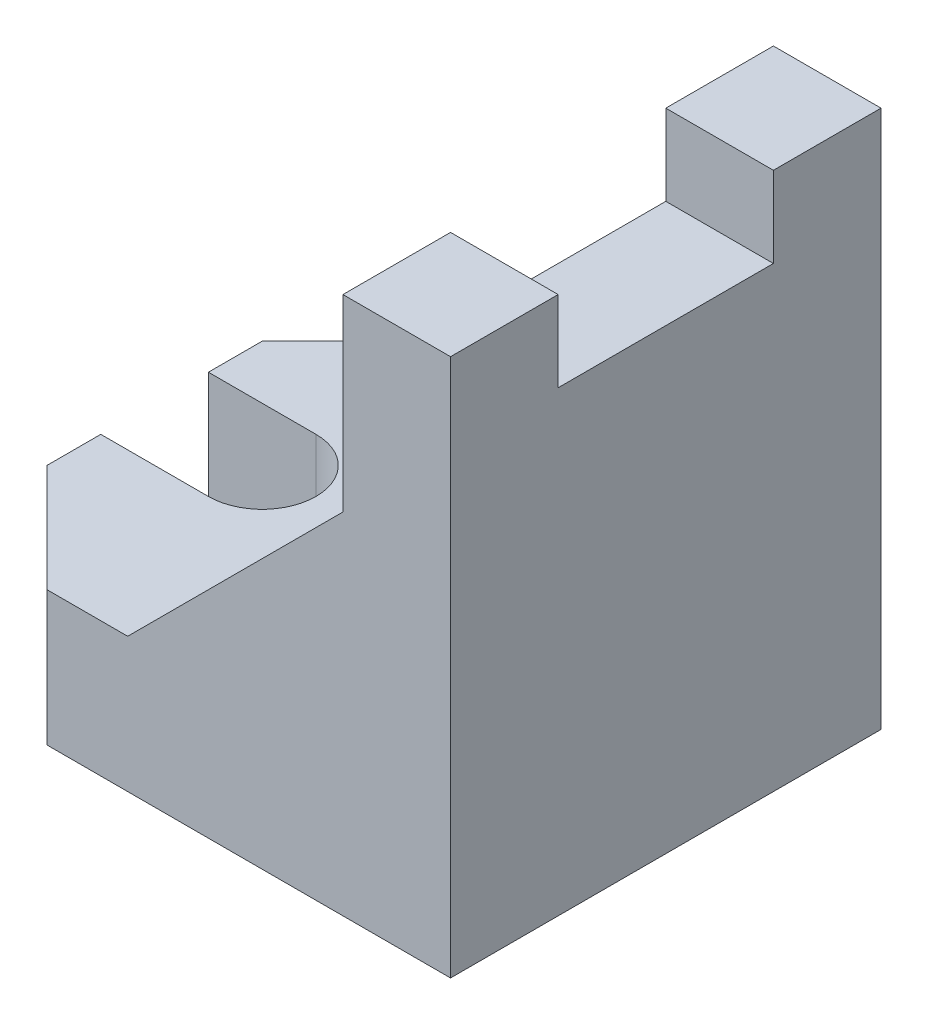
ISO-10303-21;
HEADER;
FILE_DESCRIPTION(('STEP AP214'),'2;1');
FILE_NAME('part.step','',(''),(''),'','','');
FILE_SCHEMA(('AUTOMOTIVE_DESIGN { 1 0 10303 214 1 1 1 1 }'));
ENDSEC;
DATA;
#1=APPLICATION_CONTEXT('core data for automotive mechanical design processes');
#2=APPLICATION_PROTOCOL_DEFINITION('international standard','automotive_design',2000,#1);
#3=PRODUCT_CONTEXT('',#1,'mechanical');
#4=PRODUCT('Part','Part','',(#3));
#5=PRODUCT_RELATED_PRODUCT_CATEGORY('part','',(#4));
#6=PRODUCT_DEFINITION_FORMATION('','',#4);
#7=PRODUCT_DEFINITION_CONTEXT('part definition',#1,'design');
#8=PRODUCT_DEFINITION('design','',#6,#7);
#9=PRODUCT_DEFINITION_SHAPE('','',#8);
#10=(LENGTH_UNIT() NAMED_UNIT(*) SI_UNIT(.MILLI.,.METRE.));
#11=(NAMED_UNIT(*) PLANE_ANGLE_UNIT() SI_UNIT($,.RADIAN.));
#12=(NAMED_UNIT(*) SI_UNIT($,.STERADIAN.) SOLID_ANGLE_UNIT());
#13=UNCERTAINTY_MEASURE_WITH_UNIT(LENGTH_MEASURE(1.E-05),#10,'distance_accuracy_value','');
#14=(GEOMETRIC_REPRESENTATION_CONTEXT(3) GLOBAL_UNCERTAINTY_ASSIGNED_CONTEXT((#13)) GLOBAL_UNIT_ASSIGNED_CONTEXT((#10,
#11,#12)) REPRESENTATION_CONTEXT('',''));
#15=CARTESIAN_POINT('',(0.,0.,0.));
#16=DIRECTION('',(0.,0.,1.));
#17=DIRECTION('',(1.,0.,0.));
#18=AXIS2_PLACEMENT_3D('',#15,#16,#17);
#19=CARTESIAN_POINT('',(94.9999999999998,100.,40.));
#20=DIRECTION('',(0.,-1.,0.));
#21=DIRECTION('',(0.,0.,-1.));
#22=AXIS2_PLACEMENT_3D('',#19,#20,#21);
#23=PLANE('',#22);
#24=DIRECTION('',(0.,0.,-1.));
#25=VECTOR('',#24,1.);
#26=CARTESIAN_POINT('',(74.9999999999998,100.,40.));
#27=LINE('',#26,#25);
#28=CARTESIAN_POINT('',(74.9999999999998,100.,-20.));
#29=VERTEX_POINT('',#28);
#30=CARTESIAN_POINT('',(74.9999999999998,100.,-40.));
#31=VERTEX_POINT('',#30);
#32=EDGE_CURVE('E285',#29,#31,#27,.T.);
#33=ORIENTED_EDGE('',*,*,#32,.F.);
#34=DIRECTION('',(-1.,0.,0.));
#35=VECTOR('',#34,1.);
#36=CARTESIAN_POINT('',(94.9999999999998,100.,-20.));
#37=LINE('',#36,#35);
#38=CARTESIAN_POINT('',(94.9999999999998,100.,-20.));
#39=VERTEX_POINT('',#38);
#40=EDGE_CURVE('E197',#39,#29,#37,.T.);
#41=ORIENTED_EDGE('',*,*,#40,.F.);
#42=DIRECTION('',(0.,0.,-1.));
#43=VECTOR('',#42,1.);
#44=CARTESIAN_POINT('',(94.9999999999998,100.,40.));
#45=LINE('',#44,#43);
#46=CARTESIAN_POINT('',(94.9999999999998,100.,-40.));
#47=VERTEX_POINT('',#46);
#48=EDGE_CURVE('E188',#39,#47,#45,.T.);
#49=ORIENTED_EDGE('',*,*,#48,.T.);
#50=DIRECTION('',(-1.,0.,0.));
#51=VECTOR('',#50,1.);
#52=CARTESIAN_POINT('',(94.9999999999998,100.,-40.));
#53=LINE('',#52,#51);
#54=EDGE_CURVE('E263',#47,#31,#53,.T.);
#55=ORIENTED_EDGE('',*,*,#54,.T.);
#56=EDGE_LOOP('',(#33,#41,#49,#55));
#57=FACE_BOUND('',#56,.T.);
#58=ADVANCED_FACE('F31',(#57),#23,.F.);
#59=CARTESIAN_POINT('',(74.9999999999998,65.,40.));
#60=DIRECTION('',(0.707106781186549,-0.707106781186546,0.));
#61=DIRECTION('',(0.707106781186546,0.707106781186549,0.));
#62=AXIS2_PLACEMENT_3D('',#59,#60,#61);
#63=PLANE('',#62);
#64=DIRECTION('',(-0.707106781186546,-0.707106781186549,0.));
#65=VECTOR('',#64,1.);
#66=CARTESIAN_POINT('',(35.,25.,-20.));
#67=LINE('',#66,#65);
#68=CARTESIAN_POINT('',(74.9999999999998,65.,-20.));
#69=VERTEX_POINT('',#68);
#70=CARTESIAN_POINT('',(35.,25.,-20.));
#71=VERTEX_POINT('',#70);
#72=EDGE_CURVE('E54',#69,#71,#67,.T.);
#73=ORIENTED_EDGE('',*,*,#72,.F.);
#74=DIRECTION('',(0.,0.,-1.));
#75=VECTOR('',#74,1.);
#76=CARTESIAN_POINT('',(74.9999999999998,65.,40.));
#77=LINE('',#76,#75);
#78=CARTESIAN_POINT('',(74.9999999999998,65.,-40.));
#79=VERTEX_POINT('',#78);
#80=EDGE_CURVE('E281',#69,#79,#77,.T.);
#81=ORIENTED_EDGE('',*,*,#80,.T.);
#82=DIRECTION('',(-0.707106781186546,-0.707106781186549,0.));
#83=VECTOR('',#82,1.);
#84=CARTESIAN_POINT('',(74.9999999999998,65.,-40.));
#85=LINE('',#84,#83);
#86=CARTESIAN_POINT('',(35.,25.,-40.));
#87=VERTEX_POINT('',#86);
#88=EDGE_CURVE('E269',#79,#87,#85,.T.);
#89=ORIENTED_EDGE('',*,*,#88,.T.);
#90=DIRECTION('',(0.,0.,-1.));
#91=VECTOR('',#90,1.);
#92=CARTESIAN_POINT('',(35.,25.,40.));
#93=LINE('',#92,#91);
#94=EDGE_CURVE('E277',#71,#87,#93,.T.);
#95=ORIENTED_EDGE('',*,*,#94,.F.);
#96=EDGE_LOOP('',(#73,#81,#89,#95));
#97=FACE_BOUND('',#96,.T.);
#98=ADVANCED_FACE('F367',(#97),#63,.F.);
#99=CARTESIAN_POINT('',(0.,25.,40.));
#100=DIRECTION('',(1.,0.,0.));
#101=DIRECTION('',(0.,1.,0.));
#102=AXIS2_PLACEMENT_3D('',#99,#100,#101);
#103=PLANE('',#102);
#104=DIRECTION('',(0.,0.,-1.));
#105=VECTOR('',#104,1.);
#106=CARTESIAN_POINT('',(0.,0.,40.));
#107=LINE('',#106,#105);
#108=CARTESIAN_POINT('',(0.,0.,-10.));
#109=VERTEX_POINT('',#108);
#110=CARTESIAN_POINT('',(0.,0.,-20.));
#111=VERTEX_POINT('',#110);
#112=EDGE_CURVE('E295',#109,#111,#107,.T.);
#113=ORIENTED_EDGE('',*,*,#112,.F.);
#114=DIRECTION('',(0.,1.,0.));
#115=VECTOR('',#114,1.);
#116=CARTESIAN_POINT('',(0.,0.,-10.));
#117=LINE('',#116,#115);
#118=CARTESIAN_POINT('',(0.,25.,-10.));
#119=VERTEX_POINT('',#118);
#120=EDGE_CURVE('E236',#109,#119,#117,.T.);
#121=ORIENTED_EDGE('',*,*,#120,.T.);
#122=DIRECTION('',(0.,0.,-1.));
#123=VECTOR('',#122,1.);
#124=CARTESIAN_POINT('',(0.,25.,40.));
#125=LINE('',#124,#123);
#126=CARTESIAN_POINT('',(0.,25.,-20.));
#127=VERTEX_POINT('',#126);
#128=EDGE_CURVE('E259',#119,#127,#125,.T.);
#129=ORIENTED_EDGE('',*,*,#128,.T.);
#130=DIRECTION('',(0.,-1.,0.));
#131=VECTOR('',#130,1.);
#132=CARTESIAN_POINT('',(0.,25.,-20.));
#133=LINE('',#132,#131);
#134=EDGE_CURVE('E301',#127,#111,#133,.T.);
#135=ORIENTED_EDGE('',*,*,#134,.T.);
#136=EDGE_LOOP('',(#113,#121,#129,#135));
#137=FACE_BOUND('',#136,.T.);
#138=ADVANCED_FACE('F325',(#137),#103,.F.);
#139=CARTESIAN_POINT('',(0.,25.,19.9999999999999));
#140=VERTEX_POINT('',#139);
#141=CARTESIAN_POINT('',(0.,25.,10.));
#142=VERTEX_POINT('',#141);
#143=EDGE_CURVE('E274',#140,#142,#125,.T.);
#144=ORIENTED_EDGE('',*,*,#143,.T.);
#145=DIRECTION('',(0.,1.,0.));
#146=VECTOR('',#145,1.);
#147=CARTESIAN_POINT('',(0.,0.,10.));
#148=LINE('',#147,#146);
#149=CARTESIAN_POINT('',(0.,0.,10.));
#150=VERTEX_POINT('',#149);
#151=EDGE_CURVE('E229',#150,#142,#148,.T.);
#152=ORIENTED_EDGE('',*,*,#151,.F.);
#153=CARTESIAN_POINT('',(0.,0.,19.9999999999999));
#154=VERTEX_POINT('',#153);
#155=EDGE_CURVE('E296',#154,#150,#107,.T.);
#156=ORIENTED_EDGE('',*,*,#155,.F.);
#157=DIRECTION('',(0.,1.,0.));
#158=VECTOR('',#157,1.);
#159=CARTESIAN_POINT('',(0.,25.,19.9999999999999));
#160=LINE('',#159,#158);
#161=EDGE_CURVE('E299',#154,#140,#160,.T.);
#162=ORIENTED_EDGE('',*,*,#161,.T.);
#163=EDGE_LOOP('',(#144,#152,#156,#162));
#164=FACE_BOUND('',#163,.T.);
#165=ADVANCED_FACE('F341',(#164),#103,.F.);
#166=CARTESIAN_POINT('',(0.,0.,40.));
#167=DIRECTION('',(0.,1.,0.));
#168=DIRECTION('',(0.,0.,1.));
#169=AXIS2_PLACEMENT_3D('',#166,#167,#168);
#170=PLANE('',#169);
#171=CARTESIAN_POINT('',(20.,0.,0.));
#172=DIRECTION('',(0.,1.,0.));
#173=DIRECTION('',(-1.,0.,0.));
#174=AXIS2_PLACEMENT_3D('',#171,#172,#173);
#175=CIRCLE('',#174,10.);
#176=CARTESIAN_POINT('',(20.,0.,10.));
#177=VERTEX_POINT('',#176);
#178=CARTESIAN_POINT('',(20.,0.,-10.));
#179=VERTEX_POINT('',#178);
#180=EDGE_CURVE('E222',#177,#179,#175,.T.);
#181=ORIENTED_EDGE('',*,*,#180,.T.);
#182=DIRECTION('',(-1.,0.,0.));
#183=VECTOR('',#182,1.);
#184=CARTESIAN_POINT('',(0.,0.,-10.));
#185=LINE('',#184,#183);
#186=EDGE_CURVE('E226',#179,#109,#185,.T.);
#187=ORIENTED_EDGE('',*,*,#186,.T.);
#188=ORIENTED_EDGE('',*,*,#112,.T.);
#189=DIRECTION('',(-0.707106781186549,0.,0.707106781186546));
#190=VECTOR('',#189,1.);
#191=CARTESIAN_POINT('',(0.,0.,-20.));
#192=LINE('',#191,#190);
#193=CARTESIAN_POINT('',(20.0000000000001,0.,-40.));
#194=VERTEX_POINT('',#193);
#195=EDGE_CURVE('E306',#111,#194,#192,.F.);
#196=ORIENTED_EDGE('',*,*,#195,.T.);
#197=DIRECTION('',(1.,0.,0.));
#198=VECTOR('',#197,1.);
#199=CARTESIAN_POINT('',(0.,0.,-40.));
#200=LINE('',#199,#198);
#201=CARTESIAN_POINT('',(94.9999999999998,0.,-40.));
#202=VERTEX_POINT('',#201);
#203=EDGE_CURVE('E239',#194,#202,#200,.T.);
#204=ORIENTED_EDGE('',*,*,#203,.T.);
#205=DIRECTION('',(0.,0.,-1.));
#206=VECTOR('',#205,1.);
#207=CARTESIAN_POINT('',(94.9999999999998,0.,40.));
#208=LINE('',#207,#206);
#209=CARTESIAN_POINT('',(94.9999999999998,0.,40.));
#210=VERTEX_POINT('',#209);
#211=EDGE_CURVE('E292',#210,#202,#208,.T.);
#212=ORIENTED_EDGE('',*,*,#211,.F.);
#213=DIRECTION('',(1.,0.,0.));
#214=VECTOR('',#213,1.);
#215=CARTESIAN_POINT('',(0.,0.,40.));
#216=LINE('',#215,#214);
#217=CARTESIAN_POINT('',(20.,0.,40.));
#218=VERTEX_POINT('',#217);
#219=EDGE_CURVE('E245',#218,#210,#216,.T.);
#220=ORIENTED_EDGE('',*,*,#219,.F.);
#221=DIRECTION('',(-0.707106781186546,0.,-0.707106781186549));
#222=VECTOR('',#221,1.);
#223=CARTESIAN_POINT('',(20.,0.,40.));
#224=LINE('',#223,#222);
#225=EDGE_CURVE('E304',#218,#154,#224,.T.);
#226=ORIENTED_EDGE('',*,*,#225,.T.);
#227=ORIENTED_EDGE('',*,*,#155,.T.);
#228=DIRECTION('',(1.,0.,0.));
#229=VECTOR('',#228,1.);
#230=CARTESIAN_POINT('',(0.,0.,10.));
#231=LINE('',#230,#229);
#232=EDGE_CURVE('E219',#150,#177,#231,.T.);
#233=ORIENTED_EDGE('',*,*,#232,.T.);
#234=EDGE_LOOP('',(#181,#187,#188,#196,#204,#212,#220,#226,#227,#233));
#235=FACE_BOUND('',#234,.T.);
#236=ADVANCED_FACE('F330',(#235),#170,.F.);
#237=CARTESIAN_POINT('',(94.9999999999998,0.,40.));
#238=DIRECTION('',(-1.,0.,0.));
#239=DIRECTION('',(0.,0.,1.));
#240=AXIS2_PLACEMENT_3D('',#237,#238,#239);
#241=PLANE('',#240);
#242=ORIENTED_EDGE('',*,*,#48,.F.);
#243=DIRECTION('',(0.,-1.,0.));
#244=VECTOR('',#243,1.);
#245=CARTESIAN_POINT('',(94.9999999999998,100.,-20.));
#246=LINE('',#245,#244);
#247=CARTESIAN_POINT('',(94.9999999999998,85.,-20.));
#248=VERTEX_POINT('',#247);
#249=EDGE_CURVE('E170',#39,#248,#246,.T.);
#250=ORIENTED_EDGE('',*,*,#249,.T.);
#251=DIRECTION('',(0.,0.,1.));
#252=VECTOR('',#251,1.);
#253=CARTESIAN_POINT('',(94.9999999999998,85.,-20.));
#254=LINE('',#253,#252);
#255=CARTESIAN_POINT('',(94.9999999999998,85.,20.));
#256=VERTEX_POINT('',#255);
#257=EDGE_CURVE('E179',#248,#256,#254,.T.);
#258=ORIENTED_EDGE('',*,*,#257,.T.);
#259=DIRECTION('',(0.,1.,0.));
#260=VECTOR('',#259,1.);
#261=CARTESIAN_POINT('',(94.9999999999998,100.,20.));
#262=LINE('',#261,#260);
#263=CARTESIAN_POINT('',(94.9999999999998,100.,20.));
#264=VERTEX_POINT('',#263);
#265=EDGE_CURVE('E176',#256,#264,#262,.T.);
#266=ORIENTED_EDGE('',*,*,#265,.T.);
#267=CARTESIAN_POINT('',(94.9999999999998,100.,40.));
#268=VERTEX_POINT('',#267);
#269=EDGE_CURVE('E289',#268,#264,#45,.T.);
#270=ORIENTED_EDGE('',*,*,#269,.F.);
#271=DIRECTION('',(0.,1.,0.));
#272=VECTOR('',#271,1.);
#273=CARTESIAN_POINT('',(94.9999999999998,0.,40.));
#274=LINE('',#273,#272);
#275=EDGE_CURVE('E247',#210,#268,#274,.T.);
#276=ORIENTED_EDGE('',*,*,#275,.F.);
#277=ORIENTED_EDGE('',*,*,#211,.T.);
#278=DIRECTION('',(0.,1.,0.));
#279=VECTOR('',#278,1.);
#280=CARTESIAN_POINT('',(94.9999999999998,0.,-40.));
#281=LINE('',#280,#279);
#282=EDGE_CURVE('E261',#202,#47,#281,.T.);
#283=ORIENTED_EDGE('',*,*,#282,.T.);
#284=EDGE_LOOP('',(#242,#250,#258,#266,#270,#276,#277,#283));
#285=FACE_BOUND('',#284,.T.);
#286=ADVANCED_FACE('F186',(#285),#241,.F.);
#287=ORIENTED_EDGE('',*,*,#269,.T.);
#288=DIRECTION('',(-1.,0.,0.));
#289=VECTOR('',#288,1.);
#290=CARTESIAN_POINT('',(94.9999999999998,100.,20.));
#291=LINE('',#290,#289);
#292=CARTESIAN_POINT('',(74.9999999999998,100.,20.));
#293=VERTEX_POINT('',#292);
#294=EDGE_CURVE('E200',#264,#293,#291,.T.);
#295=ORIENTED_EDGE('',*,*,#294,.T.);
#296=CARTESIAN_POINT('',(74.9999999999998,100.,40.));
#297=VERTEX_POINT('',#296);
#298=EDGE_CURVE('E286',#297,#293,#27,.T.);
#299=ORIENTED_EDGE('',*,*,#298,.F.);
#300=DIRECTION('',(-1.,0.,0.));
#301=VECTOR('',#300,1.);
#302=CARTESIAN_POINT('',(94.9999999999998,100.,40.));
#303=LINE('',#302,#301);
#304=EDGE_CURVE('E250',#268,#297,#303,.T.);
#305=ORIENTED_EDGE('',*,*,#304,.F.);
#306=EDGE_LOOP('',(#287,#295,#299,#305));
#307=FACE_BOUND('',#306,.T.);
#308=ADVANCED_FACE('F381',(#307),#23,.F.);
#309=CARTESIAN_POINT('',(74.9999999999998,100.,40.));
#310=DIRECTION('',(1.,0.,0.));
#311=DIRECTION('',(0.,0.,-1.));
#312=AXIS2_PLACEMENT_3D('',#309,#310,#311);
#313=PLANE('',#312);
#314=DIRECTION('',(0.,0.,1.));
#315=VECTOR('',#314,1.);
#316=CARTESIAN_POINT('',(74.9999999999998,85.,-20.));
#317=LINE('',#316,#315);
#318=CARTESIAN_POINT('',(74.9999999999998,85.,-20.));
#319=VERTEX_POINT('',#318);
#320=CARTESIAN_POINT('',(74.9999999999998,85.,20.));
#321=VERTEX_POINT('',#320);
#322=EDGE_CURVE('E191',#319,#321,#317,.T.);
#323=ORIENTED_EDGE('',*,*,#322,.F.);
#324=DIRECTION('',(0.,-1.,0.));
#325=VECTOR('',#324,1.);
#326=CARTESIAN_POINT('',(74.9999999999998,100.,-20.));
#327=LINE('',#326,#325);
#328=EDGE_CURVE('E46',#29,#319,#327,.T.);
#329=ORIENTED_EDGE('',*,*,#328,.F.);
#330=ORIENTED_EDGE('',*,*,#32,.T.);
#331=DIRECTION('',(0.,-1.,0.));
#332=VECTOR('',#331,1.);
#333=CARTESIAN_POINT('',(74.9999999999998,100.,-40.));
#334=LINE('',#333,#332);
#335=EDGE_CURVE('E266',#31,#79,#334,.T.);
#336=ORIENTED_EDGE('',*,*,#335,.T.);
#337=ORIENTED_EDGE('',*,*,#80,.F.);
#338=DIRECTION('',(0.,1.,0.));
#339=VECTOR('',#338,1.);
#340=CARTESIAN_POINT('',(74.9999999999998,65.,-20.));
#341=LINE('',#340,#339);
#342=CARTESIAN_POINT('',(74.9999999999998,25.,-20.));
#343=VERTEX_POINT('',#342);
#344=EDGE_CURVE('E206',#343,#69,#341,.T.);
#345=ORIENTED_EDGE('',*,*,#344,.F.);
#346=DIRECTION('',(0.,0.,1.));
#347=VECTOR('',#346,1.);
#348=CARTESIAN_POINT('',(74.9999999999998,25.,-20.));
#349=LINE('',#348,#347);
#350=CARTESIAN_POINT('',(74.9999999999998,25.,20.));
#351=VERTEX_POINT('',#350);
#352=EDGE_CURVE('E210',#343,#351,#349,.T.);
#353=ORIENTED_EDGE('',*,*,#352,.T.);
#354=DIRECTION('',(0.,1.,0.));
#355=VECTOR('',#354,1.);
#356=CARTESIAN_POINT('',(74.9999999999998,65.,20.));
#357=LINE('',#356,#355);
#358=CARTESIAN_POINT('',(74.9999999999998,65.,20.));
#359=VERTEX_POINT('',#358);
#360=EDGE_CURVE('E213',#351,#359,#357,.T.);
#361=ORIENTED_EDGE('',*,*,#360,.T.);
#362=CARTESIAN_POINT('',(74.9999999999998,65.,40.));
#363=VERTEX_POINT('',#362);
#364=EDGE_CURVE('E282',#363,#359,#77,.T.);
#365=ORIENTED_EDGE('',*,*,#364,.F.);
#366=DIRECTION('',(0.,-1.,0.));
#367=VECTOR('',#366,1.);
#368=CARTESIAN_POINT('',(74.9999999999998,100.,40.));
#369=LINE('',#368,#367);
#370=EDGE_CURVE('E252',#297,#363,#369,.T.);
#371=ORIENTED_EDGE('',*,*,#370,.F.);
#372=ORIENTED_EDGE('',*,*,#298,.T.);
#373=DIRECTION('',(0.,1.,0.));
#374=VECTOR('',#373,1.);
#375=CARTESIAN_POINT('',(74.9999999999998,100.,20.));
#376=LINE('',#375,#374);
#377=EDGE_CURVE('E189',#321,#293,#376,.T.);
#378=ORIENTED_EDGE('',*,*,#377,.F.);
#379=EDGE_LOOP('',(#323,#329,#330,#336,#337,#345,#353,#361,#365,#371,#372,#378));
#380=FACE_BOUND('',#379,.T.);
#381=ADVANCED_FACE('F362',(#380),#313,.F.);
#382=ORIENTED_EDGE('',*,*,#364,.T.);
#383=DIRECTION('',(-0.707106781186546,-0.707106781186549,0.));
#384=VECTOR('',#383,1.);
#385=CARTESIAN_POINT('',(35.,25.,20.));
#386=LINE('',#385,#384);
#387=CARTESIAN_POINT('',(35.,25.,20.));
#388=VERTEX_POINT('',#387);
#389=EDGE_CURVE('E207',#359,#388,#386,.T.);
#390=ORIENTED_EDGE('',*,*,#389,.T.);
#391=CARTESIAN_POINT('',(35.,25.,40.));
#392=VERTEX_POINT('',#391);
#393=EDGE_CURVE('E278',#392,#388,#93,.T.);
#394=ORIENTED_EDGE('',*,*,#393,.F.);
#395=DIRECTION('',(-0.707106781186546,-0.707106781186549,0.));
#396=VECTOR('',#395,1.);
#397=CARTESIAN_POINT('',(74.9999999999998,65.,40.));
#398=LINE('',#397,#396);
#399=EDGE_CURVE('E254',#363,#392,#398,.T.);
#400=ORIENTED_EDGE('',*,*,#399,.F.);
#401=EDGE_LOOP('',(#382,#390,#394,#400));
#402=FACE_BOUND('',#401,.T.);
#403=ADVANCED_FACE('F355',(#402),#63,.F.);
#404=CARTESIAN_POINT('',(35.,25.,40.));
#405=DIRECTION('',(0.,-1.,0.));
#406=DIRECTION('',(1.,0.,0.));
#407=AXIS2_PLACEMENT_3D('',#404,#405,#406);
#408=PLANE('',#407);
#409=ORIENTED_EDGE('',*,*,#128,.F.);
#410=DIRECTION('',(-1.,0.,0.));
#411=VECTOR('',#410,1.);
#412=CARTESIAN_POINT('',(0.,25.,-10.));
#413=LINE('',#412,#411);
#414=CARTESIAN_POINT('',(20.,25.,-10.));
#415=VERTEX_POINT('',#414);
#416=EDGE_CURVE('E223',#415,#119,#413,.T.);
#417=ORIENTED_EDGE('',*,*,#416,.F.);
#418=CARTESIAN_POINT('',(20.,25.,0.));
#419=DIRECTION('',(0.,1.,0.));
#420=DIRECTION('',(-1.,0.,0.));
#421=AXIS2_PLACEMENT_3D('',#418,#419,#420);
#422=CIRCLE('',#421,10.);
#423=CARTESIAN_POINT('',(20.,25.,10.));
#424=VERTEX_POINT('',#423);
#425=EDGE_CURVE('E232',#424,#415,#422,.T.);
#426=ORIENTED_EDGE('',*,*,#425,.F.);
#427=DIRECTION('',(1.,0.,0.));
#428=VECTOR('',#427,1.);
#429=CARTESIAN_POINT('',(0.,25.,10.));
#430=LINE('',#429,#428);
#431=EDGE_CURVE('E218',#142,#424,#430,.T.);
#432=ORIENTED_EDGE('',*,*,#431,.F.);
#433=ORIENTED_EDGE('',*,*,#143,.F.);
#434=DIRECTION('',(0.707106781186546,0.,0.707106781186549));
#435=VECTOR('',#434,1.);
#436=CARTESIAN_POINT('',(20.,25.,40.));
#437=LINE('',#436,#435);
#438=CARTESIAN_POINT('',(20.,25.,40.));
#439=VERTEX_POINT('',#438);
#440=EDGE_CURVE('E310',#140,#439,#437,.T.);
#441=ORIENTED_EDGE('',*,*,#440,.T.);
#442=DIRECTION('',(-1.,0.,0.));
#443=VECTOR('',#442,1.);
#444=CARTESIAN_POINT('',(35.,25.,40.));
#445=LINE('',#444,#443);
#446=EDGE_CURVE('E256',#392,#439,#445,.T.);
#447=ORIENTED_EDGE('',*,*,#446,.F.);
#448=ORIENTED_EDGE('',*,*,#393,.T.);
#449=DIRECTION('',(1.,0.,0.));
#450=VECTOR('',#449,1.);
#451=CARTESIAN_POINT('',(74.9999999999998,25.,20.));
#452=LINE('',#451,#450);
#453=EDGE_CURVE('E199',#388,#351,#452,.T.);
#454=ORIENTED_EDGE('',*,*,#453,.T.);
#455=ORIENTED_EDGE('',*,*,#352,.F.);
#456=DIRECTION('',(1.,0.,0.));
#457=VECTOR('',#456,1.);
#458=CARTESIAN_POINT('',(74.9999999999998,25.,-20.));
#459=LINE('',#458,#457);
#460=EDGE_CURVE('E204',#71,#343,#459,.T.);
#461=ORIENTED_EDGE('',*,*,#460,.F.);
#462=ORIENTED_EDGE('',*,*,#94,.T.);
#463=DIRECTION('',(-1.,0.,0.));
#464=VECTOR('',#463,1.);
#465=CARTESIAN_POINT('',(35.,25.,-40.));
#466=LINE('',#465,#464);
#467=CARTESIAN_POINT('',(20.0000000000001,25.,-40.));
#468=VERTEX_POINT('',#467);
#469=EDGE_CURVE('E248',#87,#468,#466,.T.);
#470=ORIENTED_EDGE('',*,*,#469,.T.);
#471=DIRECTION('',(0.707106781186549,0.,-0.707106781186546));
#472=VECTOR('',#471,1.);
#473=CARTESIAN_POINT('',(0.,25.,-20.));
#474=LINE('',#473,#472);
#475=EDGE_CURVE('E39',#468,#127,#474,.F.);
#476=ORIENTED_EDGE('',*,*,#475,.T.);
#477=EDGE_LOOP('',(#409,#417,#426,#432,#433,#441,#447,#448,#454,#455,#461,#462,#470,#476));
#478=FACE_BOUND('',#477,.T.);
#479=ADVANCED_FACE('F316',(#478),#408,.F.);
#480=CARTESIAN_POINT('',(0.,0.,40.));
#481=DIRECTION('',(0.,0.,1.));
#482=DIRECTION('',(1.,0.,0.));
#483=AXIS2_PLACEMENT_3D('',#480,#481,#482);
#484=PLANE('',#483);
#485=ORIENTED_EDGE('',*,*,#446,.T.);
#486=DIRECTION('',(0.,-1.,0.));
#487=VECTOR('',#486,1.);
#488=CARTESIAN_POINT('',(20.,0.,40.));
#489=LINE('',#488,#487);
#490=EDGE_CURVE('E11',#439,#218,#489,.T.);
#491=ORIENTED_EDGE('',*,*,#490,.T.);
#492=ORIENTED_EDGE('',*,*,#219,.T.);
#493=ORIENTED_EDGE('',*,*,#275,.T.);
#494=ORIENTED_EDGE('',*,*,#304,.T.);
#495=ORIENTED_EDGE('',*,*,#370,.T.);
#496=ORIENTED_EDGE('',*,*,#399,.T.);
#497=EDGE_LOOP('',(#485,#491,#492,#493,#494,#495,#496));
#498=FACE_BOUND('',#497,.T.);
#499=ADVANCED_FACE('F348',(#498),#484,.T.);
#500=CARTESIAN_POINT('',(0.,0.,-40.));
#501=DIRECTION('',(0.,0.,1.));
#502=DIRECTION('',(1.,0.,0.));
#503=AXIS2_PLACEMENT_3D('',#500,#501,#502);
#504=PLANE('',#503);
#505=ORIENTED_EDGE('',*,*,#203,.F.);
#506=DIRECTION('',(0.,1.,0.));
#507=VECTOR('',#506,1.);
#508=CARTESIAN_POINT('',(20.0000000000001,0.,-40.));
#509=LINE('',#508,#507);
#510=EDGE_CURVE('E308',#194,#468,#509,.T.);
#511=ORIENTED_EDGE('',*,*,#510,.T.);
#512=ORIENTED_EDGE('',*,*,#469,.F.);
#513=ORIENTED_EDGE('',*,*,#88,.F.);
#514=ORIENTED_EDGE('',*,*,#335,.F.);
#515=ORIENTED_EDGE('',*,*,#54,.F.);
#516=ORIENTED_EDGE('',*,*,#282,.F.);
#517=EDGE_LOOP('',(#505,#511,#512,#513,#514,#515,#516));
#518=FACE_BOUND('',#517,.T.);
#519=ADVANCED_FACE('F372',(#518),#504,.F.);
#520=CARTESIAN_POINT('',(0.,25.,-20.));
#521=DIRECTION('',(0.707106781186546,0.,0.707106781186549));
#522=DIRECTION('',(0.707106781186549,0.,-0.707106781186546));
#523=AXIS2_PLACEMENT_3D('',#520,#521,#522);
#524=PLANE('',#523);
#525=ORIENTED_EDGE('',*,*,#475,.F.);
#526=ORIENTED_EDGE('',*,*,#510,.F.);
#527=ORIENTED_EDGE('',*,*,#195,.F.);
#528=ORIENTED_EDGE('',*,*,#134,.F.);
#529=EDGE_LOOP('',(#525,#526,#527,#528));
#530=FACE_BOUND('',#529,.T.);
#531=ADVANCED_FACE('F322',(#530),#524,.F.);
#532=CARTESIAN_POINT('',(20.,0.,40.));
#533=DIRECTION('',(-0.707106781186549,0.,0.707106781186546));
#534=DIRECTION('',(0.707106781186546,0.,0.707106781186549));
#535=AXIS2_PLACEMENT_3D('',#532,#533,#534);
#536=PLANE('',#535);
#537=ORIENTED_EDGE('',*,*,#440,.F.);
#538=ORIENTED_EDGE('',*,*,#161,.F.);
#539=ORIENTED_EDGE('',*,*,#225,.F.);
#540=ORIENTED_EDGE('',*,*,#490,.F.);
#541=EDGE_LOOP('',(#537,#538,#539,#540));
#542=FACE_BOUND('',#541,.T.);
#543=ADVANCED_FACE('F33',(#542),#536,.T.);
#544=CARTESIAN_POINT('',(0.,0.,-10.));
#545=DIRECTION('',(0.,0.,-1.));
#546=DIRECTION('',(-1.,0.,0.));
#547=AXIS2_PLACEMENT_3D('',#544,#545,#546);
#548=PLANE('',#547);
#549=ORIENTED_EDGE('',*,*,#416,.T.);
#550=ORIENTED_EDGE('',*,*,#120,.F.);
#551=ORIENTED_EDGE('',*,*,#186,.F.);
#552=DIRECTION('',(0.,1.,0.));
#553=VECTOR('',#552,1.);
#554=CARTESIAN_POINT('',(20.,0.,-10.));
#555=LINE('',#554,#553);
#556=EDGE_CURVE('E240',#179,#415,#555,.T.);
#557=ORIENTED_EDGE('',*,*,#556,.T.);
#558=EDGE_LOOP('',(#549,#550,#551,#557));
#559=FACE_BOUND('',#558,.T.);
#560=ADVANCED_FACE('F328',(#559),#548,.F.);
#561=CARTESIAN_POINT('',(20.,0.,0.));
#562=DIRECTION('',(0.,1.,0.));
#563=DIRECTION('',(-1.,0.,0.));
#564=AXIS2_PLACEMENT_3D('',#561,#562,#563);
#565=CYLINDRICAL_SURFACE('',#564,10.);
#566=ORIENTED_EDGE('',*,*,#425,.T.);
#567=ORIENTED_EDGE('',*,*,#556,.F.);
#568=ORIENTED_EDGE('',*,*,#180,.F.);
#569=DIRECTION('',(0.,1.,0.));
#570=VECTOR('',#569,1.);
#571=CARTESIAN_POINT('',(20.,0.,10.));
#572=LINE('',#571,#570);
#573=EDGE_CURVE('E242',#177,#424,#572,.T.);
#574=ORIENTED_EDGE('',*,*,#573,.T.);
#575=EDGE_LOOP('',(#566,#567,#568,#574));
#576=FACE_BOUND('',#575,.T.);
#577=ADVANCED_FACE('F333',(#576),#565,.F.);
#578=CARTESIAN_POINT('',(0.,0.,10.));
#579=DIRECTION('',(0.,0.,1.));
#580=DIRECTION('',(1.,0.,0.));
#581=AXIS2_PLACEMENT_3D('',#578,#579,#580);
#582=PLANE('',#581);
#583=ORIENTED_EDGE('',*,*,#431,.T.);
#584=ORIENTED_EDGE('',*,*,#573,.F.);
#585=ORIENTED_EDGE('',*,*,#232,.F.);
#586=ORIENTED_EDGE('',*,*,#151,.T.);
#587=EDGE_LOOP('',(#583,#584,#585,#586));
#588=FACE_BOUND('',#587,.T.);
#589=ADVANCED_FACE('F494',(#588),#582,.F.);
#590=CARTESIAN_POINT('',(74.9999999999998,25.,-20.));
#591=DIRECTION('',(0.,0.,1.));
#592=DIRECTION('',(1.,0.,0.));
#593=AXIS2_PLACEMENT_3D('',#590,#591,#592);
#594=PLANE('',#593);
#595=ORIENTED_EDGE('',*,*,#460,.T.);
#596=ORIENTED_EDGE('',*,*,#344,.T.);
#597=ORIENTED_EDGE('',*,*,#72,.T.);
#598=EDGE_LOOP('',(#595,#596,#597));
#599=FACE_BOUND('',#598,.T.);
#600=ADVANCED_FACE('F364',(#599),#594,.T.);
#601=CARTESIAN_POINT('',(74.9999999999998,25.,20.));
#602=DIRECTION('',(0.,0.,1.));
#603=DIRECTION('',(1.,0.,0.));
#604=AXIS2_PLACEMENT_3D('',#601,#602,#603);
#605=PLANE('',#604);
#606=ORIENTED_EDGE('',*,*,#453,.F.);
#607=ORIENTED_EDGE('',*,*,#389,.F.);
#608=ORIENTED_EDGE('',*,*,#360,.F.);
#609=EDGE_LOOP('',(#606,#607,#608));
#610=FACE_BOUND('',#609,.T.);
#611=ADVANCED_FACE('F360',(#610),#605,.F.);
#612=CARTESIAN_POINT('',(94.9999999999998,100.,-20.));
#613=DIRECTION('',(0.,0.,-1.));
#614=DIRECTION('',(0.,1.,0.));
#615=AXIS2_PLACEMENT_3D('',#612,#613,#614);
#616=PLANE('',#615);
#617=ORIENTED_EDGE('',*,*,#328,.T.);
#618=DIRECTION('',(-1.,0.,0.));
#619=VECTOR('',#618,1.);
#620=CARTESIAN_POINT('',(94.9999999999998,85.,-20.));
#621=LINE('',#620,#619);
#622=EDGE_CURVE('E166',#248,#319,#621,.T.);
#623=ORIENTED_EDGE('',*,*,#622,.F.);
#624=ORIENTED_EDGE('',*,*,#249,.F.);
#625=ORIENTED_EDGE('',*,*,#40,.T.);
#626=EDGE_LOOP('',(#617,#623,#624,#625));
#627=FACE_BOUND('',#626,.T.);
#628=ADVANCED_FACE('F168',(#627),#616,.F.);
#629=CARTESIAN_POINT('',(94.9999999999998,100.,20.));
#630=DIRECTION('',(0.,0.,1.));
#631=DIRECTION('',(0.,-1.,0.));
#632=AXIS2_PLACEMENT_3D('',#629,#630,#631);
#633=PLANE('',#632);
#634=ORIENTED_EDGE('',*,*,#377,.T.);
#635=ORIENTED_EDGE('',*,*,#294,.F.);
#636=ORIENTED_EDGE('',*,*,#265,.F.);
#637=DIRECTION('',(-1.,0.,0.));
#638=VECTOR('',#637,1.);
#639=CARTESIAN_POINT('',(94.9999999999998,85.,20.));
#640=LINE('',#639,#638);
#641=EDGE_CURVE('E175',#256,#321,#640,.T.);
#642=ORIENTED_EDGE('',*,*,#641,.T.);
#643=EDGE_LOOP('',(#634,#635,#636,#642));
#644=FACE_BOUND('',#643,.T.);
#645=ADVANCED_FACE('F384',(#644),#633,.F.);
#646=CARTESIAN_POINT('',(94.9999999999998,85.,-20.));
#647=DIRECTION('',(0.,-1.,0.));
#648=DIRECTION('',(0.,0.,-1.));
#649=AXIS2_PLACEMENT_3D('',#646,#647,#648);
#650=PLANE('',#649);
#651=ORIENTED_EDGE('',*,*,#322,.T.);
#652=ORIENTED_EDGE('',*,*,#641,.F.);
#653=ORIENTED_EDGE('',*,*,#257,.F.);
#654=ORIENTED_EDGE('',*,*,#622,.T.);
#655=EDGE_LOOP('',(#651,#652,#653,#654));
#656=FACE_BOUND('',#655,.T.);
#657=ADVANCED_FACE('F180',(#656),#650,.F.);
#658=CLOSED_SHELL('',(#58,#98,#138,#165,#236,#286,#308,#381,#403,#479,#499,#519,#531,#543,#560,
#577,#589,#600,#611,#628,#645,#657));
#659=MANIFOLD_SOLID_BREP('B2',#658);
#660=ADVANCED_BREP_SHAPE_REPRESENTATION('',(#18,#659),#14);
#661=SHAPE_DEFINITION_REPRESENTATION(#9,#660);
ENDSEC;
END-ISO-10303-21;
